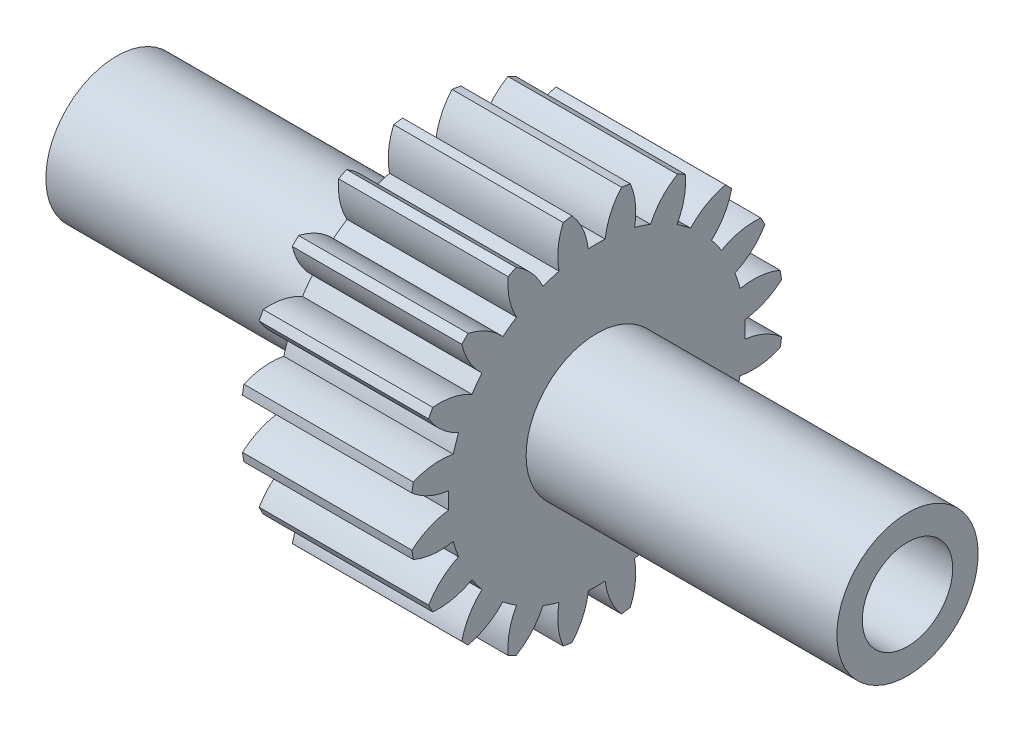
from build123d import *

# Parameters (mm, degrees)
BASPROSKE_W       = 15
BASPROSKE_H       = 16.5
TOOTHCUT_DEPTH    = 28.739863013
TEETHCUTS_COUNT   = 20
TEETHCUTS_ANGLE   = 342
HUBNEABOTSKE_R    = 6.25
HUBNEARBOTH_DEPTH = 27.5000254
HUBFAR_START      = 27.5000254
HUBFARSKE_R       = 6.25
HUBFAR_DEPTH      = 27.5000254
BORSKE_R          = 4
BORE_DEPTH        = 70.0000508


with BuildPart() as part:
    # BasProSke → Base-Revolve (revolve)
    with BuildSketch(Plane(origin=(0, 0, 0), x_dir=(1, 0, 0), z_dir=(0, 1, 0)), mode=Mode.PRIVATE) as base_revolve_sk:
        with Locations((7.5, 8.25)):
            Rectangle(BASPROSKE_W, BASPROSKE_H)
    revolve(base_revolve_sk.sketch.rotate(Axis((-10, 0, 0), (1, 0, 0)), 180), axis=Axis((-10, 0, 0), (1, 0, 0)))

    # TooCutSke → ToothCut (cut, through all)
    with BuildSketch(Plane(origin=(0, 0, 0), x_dir=(0, 0, -1), z_dir=(1, 0, 0))):
        with BuildLine():
            ThreePointArc((0.74381438, 13.102904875), (0, 13.124), (-0.74381438, 13.102904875))
            ThreePointArc((-0.74381438, 13.102904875), (-1.226473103, 14.852072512), (-2.209965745, 16.376962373))
            ThreePointArc((-2.209965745, 16.376962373), (0, 16.5254), (2.209965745, 16.376962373))
            ThreePointArc((2.209965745, 16.376962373), (1.226473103, 14.852072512), (0.74381438, 13.102904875))
        make_face()
    toothcut = extrude(amount=TOOTHCUT_DEPTH, mode=Mode.SUBTRACT)

    # TeethCuts: ToothCut ×20 about axis
    teethcuts_axis = Axis((-10, 0, 0), (1, 0, 0))
    for i in range(1, TEETHCUTS_COUNT):
        add(toothcut.rotate(teethcuts_axis, i * TEETHCUTS_ANGLE / (TEETHCUTS_COUNT - 1)), mode=Mode.SUBTRACT)

    # HubNeaBotSke → HubNearBoth (add)
    with BuildSketch(Plane.ZY):
        with Locations(Location((0, 0, 0), (0, 0, 180))):
            Circle(HUBNEABOTSKE_R)
    extrude(amount=HUBNEARBOTH_DEPTH)

    # HubFarSke → HubFar (add)
    with BuildSketch(Plane(origin=(15, 0, 0), x_dir=(0, 0, -1), z_dir=(1, 0, 0)).offset(HUBFAR_START)):
        Circle(HUBFARSKE_R)
    extrude(amount=-HUBFAR_DEPTH)

    # BorSke → Bore (cut, symmetric)
    with BuildSketch(Plane(origin=(0, 0, 0), x_dir=(0, 0, -1), z_dir=(1, 0, 0))):
        with Locations(Location((0, 0, 0), (0, 0, 180))):
            Circle(BORSKE_R)
    extrude(amount=BORE_DEPTH, both=True, mode=Mode.SUBTRACT)


solid = part.part
